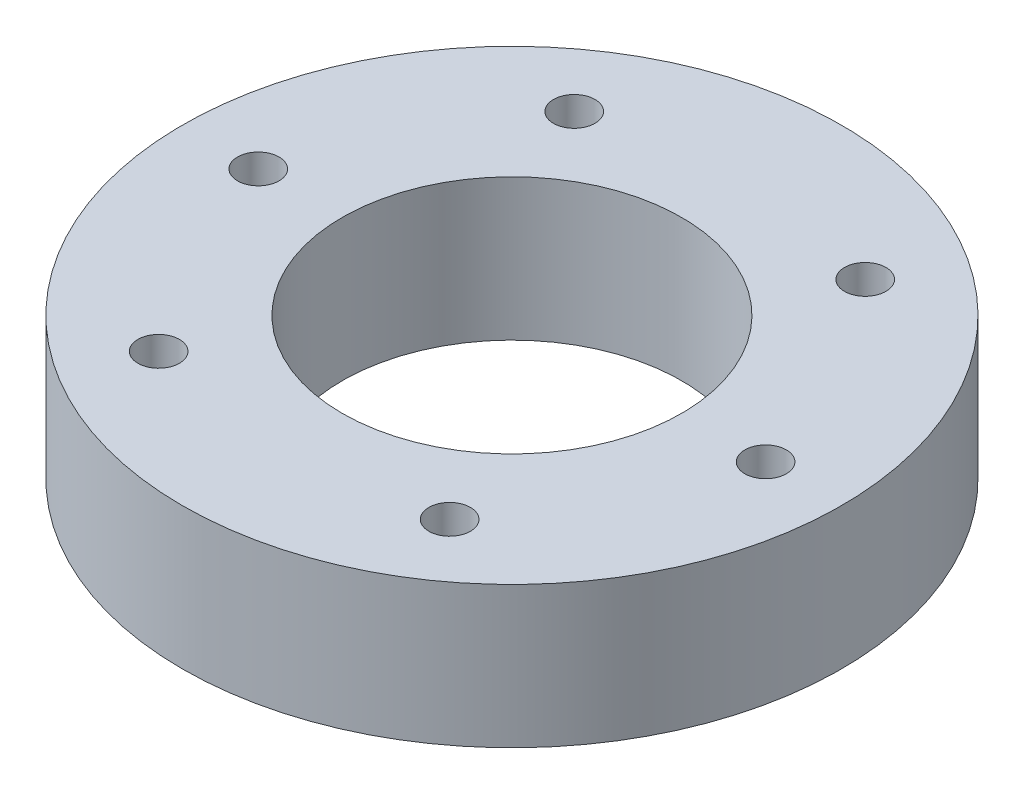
from build123d import *

# Parameters (mm, degrees)
SKETCH1_R           = 34.95
SKETCH1_R_2         = 18
BOSS_EXTRUDE1_DEPTH = 7.5
SKETCH2_R           = 2.2
CUT_EXTRUDE1_DEPTH  = 10


with BuildPart() as part:
    # Sketch1 → Boss-Extrude1 (new, symmetric)
    with BuildSketch(Plane(origin=(0, 0, 0), x_dir=(1, 0, 0), z_dir=(0, 1, 0))):
        with Locations(Location((0, 0, 0), (0, 0, 270))):
            Circle(SKETCH1_R)
        with Locations(Location((0, 0, 0), (0, 0, 270))):
            Circle(SKETCH1_R_2, mode=Mode.SUBTRACT)
    extrude(amount=BOSS_EXTRUDE1_DEPTH, both=True)

    # Sketch2 → Cut-Extrude1 (cut)
    with BuildSketch(Plane(origin=(0, 7.5, 0), x_dir=(1, 0, 0), z_dir=(0, 1, 0))):
        with Locations(Location((-15.429206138, -22.035189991, 0), (0, 0, 270))):
            Circle(SKETCH2_R)
        with Locations(Location((-26.9, 0, 0), (0, 0, 270))):
            Circle(SKETCH2_R)
        with Locations(Location((-15.429206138, 22.035189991, 0), (0, 0, 270))):
            Circle(SKETCH2_R)
        with Locations(Location((15.429206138, 22.035189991, 0), (0, 0, 270))):
            Circle(SKETCH2_R)
        with Locations(Location((26.9, 0, 0), (0, 0, 270))):
            Circle(SKETCH2_R)
        with Locations(Location((15.429206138, -22.035189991, 0), (0, 0, 270))):
            Circle(SKETCH2_R)
    extrude(amount=-CUT_EXTRUDE1_DEPTH, mode=Mode.SUBTRACT)


solid = part.part
